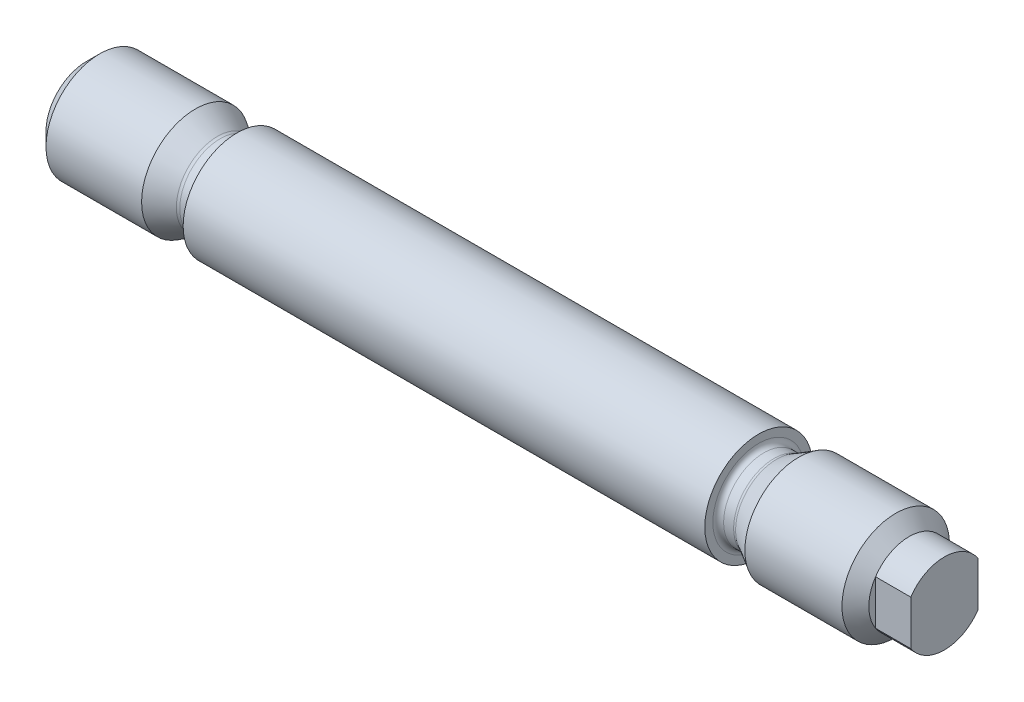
ISO-10303-21;
HEADER;
FILE_DESCRIPTION(('STEP AP214'),'2;1');
FILE_NAME('part.step','',(''),(''),'','','');
FILE_SCHEMA(('AUTOMOTIVE_DESIGN { 1 0 10303 214 1 1 1 1 }'));
ENDSEC;
DATA;
#1=APPLICATION_CONTEXT('core data for automotive mechanical design processes');
#2=APPLICATION_PROTOCOL_DEFINITION('international standard','automotive_design',2000,#1);
#3=PRODUCT_CONTEXT('',#1,'mechanical');
#4=PRODUCT('Part','Part','',(#3));
#5=PRODUCT_RELATED_PRODUCT_CATEGORY('part','',(#4));
#6=PRODUCT_DEFINITION_FORMATION('','',#4);
#7=PRODUCT_DEFINITION_CONTEXT('part definition',#1,'design');
#8=PRODUCT_DEFINITION('design','',#6,#7);
#9=PRODUCT_DEFINITION_SHAPE('','',#8);
#10=(LENGTH_UNIT() NAMED_UNIT(*) SI_UNIT(.MILLI.,.METRE.));
#11=(NAMED_UNIT(*) PLANE_ANGLE_UNIT() SI_UNIT($,.RADIAN.));
#12=(NAMED_UNIT(*) SI_UNIT($,.STERADIAN.) SOLID_ANGLE_UNIT());
#13=UNCERTAINTY_MEASURE_WITH_UNIT(LENGTH_MEASURE(1.E-05),#10,'distance_accuracy_value','');
#14=(GEOMETRIC_REPRESENTATION_CONTEXT(3) GLOBAL_UNCERTAINTY_ASSIGNED_CONTEXT((#13)) GLOBAL_UNIT_ASSIGNED_CONTEXT((#10,
#11,#12)) REPRESENTATION_CONTEXT('',''));
#15=CARTESIAN_POINT('',(0.,0.,0.));
#16=DIRECTION('',(0.,0.,1.));
#17=DIRECTION('',(1.,0.,0.));
#18=AXIS2_PLACEMENT_3D('',#15,#16,#17);
#19=CARTESIAN_POINT('',(122.4,6.,0.));
#20=DIRECTION('',(1.,0.,0.));
#21=DIRECTION('',(0.,0.,-1.));
#22=AXIS2_PLACEMENT_3D('',#19,#20,#21);
#23=PLANE('',#22);
#24=DIRECTION('',(0.,1.,0.));
#25=VECTOR('',#24,1.);
#26=CARTESIAN_POINT('',(122.4,3.3166247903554,-5.));
#27=LINE('',#26,#25);
#28=CARTESIAN_POINT('',(122.4,-3.3166247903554,-5.));
#29=VERTEX_POINT('',#28);
#30=CARTESIAN_POINT('',(122.4,3.3166247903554,-5.));
#31=VERTEX_POINT('',#30);
#32=EDGE_CURVE('E48',#29,#31,#27,.T.);
#33=ORIENTED_EDGE('',*,*,#32,.F.);
#34=CARTESIAN_POINT('',(122.4,0.,0.));
#35=DIRECTION('',(-1.,0.,0.));
#36=DIRECTION('',(0.,0.,1.));
#37=AXIS2_PLACEMENT_3D('',#34,#35,#36);
#38=CIRCLE('',#37,6.);
#39=EDGE_CURVE('E41',#31,#29,#38,.T.);
#40=ORIENTED_EDGE('',*,*,#39,.F.);
#41=EDGE_LOOP('',(#33,#40));
#42=FACE_BOUND('',#41,.T.);
#43=ADVANCED_FACE('F33',(#42),#23,.T.);
#44=CARTESIAN_POINT('',(0.,6.,0.));
#45=DIRECTION('',(1.,0.,0.));
#46=DIRECTION('',(0.,0.,-1.));
#47=AXIS2_PLACEMENT_3D('',#44,#45,#46);
#48=PLANE('',#47);
#49=CARTESIAN_POINT('',(0.,0.,0.));
#50=DIRECTION('',(-1.,0.,0.));
#51=DIRECTION('',(0.,0.,1.));
#52=AXIS2_PLACEMENT_3D('',#49,#50,#51);
#53=CIRCLE('',#52,6.);
#54=CARTESIAN_POINT('',(0.,0.,6.));
#55=VERTEX_POINT('',#54);
#56=EDGE_CURVE('E94',#55,#55,#53,.T.);
#57=ORIENTED_EDGE('',*,*,#56,.T.);
#58=EDGE_LOOP('',(#57));
#59=FACE_BOUND('',#58,.T.);
#60=ADVANCED_FACE('F35',(#59),#48,.F.);
#61=DIRECTION('',(0.,-1.,0.));
#62=VECTOR('',#61,1.);
#63=CARTESIAN_POINT('',(122.4,3.3166247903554,5.));
#64=LINE('',#63,#62);
#65=CARTESIAN_POINT('',(122.4,3.3166247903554,5.));
#66=VERTEX_POINT('',#65);
#67=CARTESIAN_POINT('',(122.4,-3.3166247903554,5.));
#68=VERTEX_POINT('',#67);
#69=EDGE_CURVE('E155',#66,#68,#64,.T.);
#70=ORIENTED_EDGE('',*,*,#69,.F.);
#71=EDGE_CURVE('E42',#68,#66,#38,.T.);
#72=ORIENTED_EDGE('',*,*,#71,.F.);
#73=EDGE_LOOP('',(#70,#72));
#74=FACE_BOUND('',#73,.T.);
#75=ADVANCED_FACE('F166',(#74),#23,.T.);
#76=CARTESIAN_POINT('',(120.4,0.,0.));
#77=DIRECTION('',(-1.,0.,0.));
#78=DIRECTION('',(0.,0.,1.));
#79=AXIS2_PLACEMENT_3D('',#76,#77,#78);
#80=CONICAL_SURFACE('',#79,8.,0.785398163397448);
#81=EDGE_CURVE('E11',#66,#31,#38,.T.);
#82=ORIENTED_EDGE('',*,*,#81,.T.);
#83=ORIENTED_EDGE('',*,*,#39,.T.);
#84=CARTESIAN_POINT('',(122.4,0.,0.));
#85=DIRECTION('',(1.,0.,0.));
#86=DIRECTION('',(0.,0.,-1.));
#87=AXIS2_PLACEMENT_3D('',#84,#85,#86);
#88=CIRCLE('',#87,6.);
#89=EDGE_CURVE('E150',#68,#29,#88,.T.);
#90=ORIENTED_EDGE('',*,*,#89,.F.);
#91=ORIENTED_EDGE('',*,*,#71,.T.);
#92=EDGE_LOOP('',(#82,#83,#90,#91));
#93=FACE_BOUND('',#92,.T.);
#94=CARTESIAN_POINT('',(120.4,0.,0.));
#95=DIRECTION('',(-1.,0.,0.));
#96=DIRECTION('',(0.,0.,1.));
#97=AXIS2_PLACEMENT_3D('',#94,#95,#96);
#98=CIRCLE('',#97,8.);
#99=CARTESIAN_POINT('',(120.4,0.,8.));
#100=VERTEX_POINT('',#99);
#101=EDGE_CURVE('E140',#100,#100,#98,.T.);
#102=ORIENTED_EDGE('',*,*,#101,.F.);
#103=EDGE_LOOP('',(#102));
#104=FACE_BOUND('',#103,.T.);
#105=ADVANCED_FACE('F148',(#93,#104),#80,.T.);
#106=CARTESIAN_POINT('',(-3.175,0.,0.));
#107=DIRECTION('',(-1.,0.,0.));
#108=DIRECTION('',(0.,0.,1.));
#109=AXIS2_PLACEMENT_3D('',#106,#107,#108);
#110=CYLINDRICAL_SURFACE('',#109,8.);
#111=ORIENTED_EDGE('',*,*,#101,.T.);
#112=EDGE_LOOP('',(#111));
#113=FACE_BOUND('',#112,.T.);
#114=CARTESIAN_POINT('',(105.964101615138,0.,0.));
#115=DIRECTION('',(-1.,0.,0.));
#116=DIRECTION('',(0.,0.,1.));
#117=AXIS2_PLACEMENT_3D('',#114,#115,#116);
#118=CIRCLE('',#117,8.);
#119=CARTESIAN_POINT('',(105.964101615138,0.,8.));
#120=VERTEX_POINT('',#119);
#121=EDGE_CURVE('E138',#120,#120,#118,.T.);
#122=ORIENTED_EDGE('',*,*,#121,.F.);
#123=EDGE_LOOP('',(#122));
#124=FACE_BOUND('',#123,.T.);
#125=ADVANCED_FACE('F172',(#113,#124),#110,.T.);
#126=CARTESIAN_POINT('',(102.685640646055,0.,0.));
#127=DIRECTION('',(1.,0.,0.));
#128=DIRECTION('',(0.,0.,-1.));
#129=AXIS2_PLACEMENT_3D('',#126,#127,#128);
#130=CONICAL_SURFACE('',#129,6.10717967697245,0.523598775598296);
#131=ORIENTED_EDGE('',*,*,#121,.T.);
#132=EDGE_LOOP('',(#131));
#133=FACE_BOUND('',#132,.T.);
#134=CARTESIAN_POINT('',(102.685640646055,0.,0.));
#135=DIRECTION('',(-1.,0.,0.));
#136=DIRECTION('',(0.,0.,1.));
#137=AXIS2_PLACEMENT_3D('',#134,#135,#136);
#138=CIRCLE('',#137,6.10717967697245);
#139=CARTESIAN_POINT('',(102.685640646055,0.,6.10717967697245));
#140=VERTEX_POINT('',#139);
#141=EDGE_CURVE('E135',#140,#140,#138,.T.);
#142=ORIENTED_EDGE('',*,*,#141,.F.);
#143=EDGE_LOOP('',(#142));
#144=FACE_BOUND('',#143,.T.);
#145=ADVANCED_FACE('F193',(#133,#144),#130,.T.);
#146=CARTESIAN_POINT('',(102.285640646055,0.,0.));
#147=DIRECTION('',(-1.,0.,0.));
#148=DIRECTION('',(0.,0.,1.));
#149=AXIS2_PLACEMENT_3D('',#146,#147,#148);
#150=TOROIDAL_SURFACE('',#149,6.8,0.8);
#151=ORIENTED_EDGE('',*,*,#141,.T.);
#152=EDGE_LOOP('',(#151));
#153=FACE_BOUND('',#152,.T.);
#154=CARTESIAN_POINT('',(102.285640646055,0.,0.));
#155=DIRECTION('',(-1.,0.,0.));
#156=DIRECTION('',(0.,0.,1.));
#157=AXIS2_PLACEMENT_3D('',#154,#155,#156);
#158=CIRCLE('',#157,6.);
#159=CARTESIAN_POINT('',(102.285640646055,0.,6.));
#160=VERTEX_POINT('',#159);
#161=EDGE_CURVE('E132',#160,#160,#158,.T.);
#162=ORIENTED_EDGE('',*,*,#161,.F.);
#163=EDGE_LOOP('',(#162));
#164=FACE_BOUND('',#163,.T.);
#165=ADVANCED_FACE('F203',(#153,#164),#150,.F.);
#166=CARTESIAN_POINT('',(-3.175,0.,0.));
#167=DIRECTION('',(-1.,0.,0.));
#168=DIRECTION('',(0.,0.,1.));
#169=AXIS2_PLACEMENT_3D('',#166,#167,#168);
#170=CYLINDRICAL_SURFACE('',#169,6.);
#171=ORIENTED_EDGE('',*,*,#161,.T.);
#172=EDGE_LOOP('',(#171));
#173=FACE_BOUND('',#172,.T.);
#174=CARTESIAN_POINT('',(100.8,0.,0.));
#175=DIRECTION('',(-1.,0.,0.));
#176=DIRECTION('',(0.,0.,1.));
#177=AXIS2_PLACEMENT_3D('',#174,#175,#176);
#178=CIRCLE('',#177,6.);
#179=CARTESIAN_POINT('',(100.8,0.,6.));
#180=VERTEX_POINT('',#179);
#181=EDGE_CURVE('E129',#180,#180,#178,.T.);
#182=ORIENTED_EDGE('',*,*,#181,.F.);
#183=EDGE_LOOP('',(#182));
#184=FACE_BOUND('',#183,.T.);
#185=ADVANCED_FACE('F213',(#173,#184),#170,.T.);
#186=CARTESIAN_POINT('',(100.8,0.,0.));
#187=DIRECTION('',(-1.,0.,0.));
#188=DIRECTION('',(0.,0.,1.));
#189=AXIS2_PLACEMENT_3D('',#186,#187,#188);
#190=TOROIDAL_SURFACE('',#189,6.8,0.799999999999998);
#191=ORIENTED_EDGE('',*,*,#181,.T.);
#192=EDGE_LOOP('',(#191));
#193=FACE_BOUND('',#192,.T.);
#194=CARTESIAN_POINT('',(100.,0.,0.));
#195=DIRECTION('',(-1.,0.,0.));
#196=DIRECTION('',(0.,0.,1.));
#197=AXIS2_PLACEMENT_3D('',#194,#195,#196);
#198=CIRCLE('',#197,6.8);
#199=CARTESIAN_POINT('',(100.,0.,6.8));
#200=VERTEX_POINT('',#199);
#201=EDGE_CURVE('E126',#200,#200,#198,.T.);
#202=ORIENTED_EDGE('',*,*,#201,.F.);
#203=EDGE_LOOP('',(#202));
#204=FACE_BOUND('',#203,.T.);
#205=ADVANCED_FACE('F223',(#193,#204),#190,.F.);
#206=CARTESIAN_POINT('',(100.,8.,0.));
#207=DIRECTION('',(1.,0.,0.));
#208=DIRECTION('',(0.,0.,-1.));
#209=AXIS2_PLACEMENT_3D('',#206,#207,#208);
#210=PLANE('',#209);
#211=ORIENTED_EDGE('',*,*,#201,.T.);
#212=EDGE_LOOP('',(#211));
#213=FACE_BOUND('',#212,.T.);
#214=CARTESIAN_POINT('',(100.,0.,0.));
#215=DIRECTION('',(-1.,0.,0.));
#216=DIRECTION('',(0.,0.,1.));
#217=AXIS2_PLACEMENT_3D('',#214,#215,#216);
#218=CIRCLE('',#217,8.);
#219=CARTESIAN_POINT('',(100.,0.,8.));
#220=VERTEX_POINT('',#219);
#221=EDGE_CURVE('E123',#220,#220,#218,.T.);
#222=ORIENTED_EDGE('',*,*,#221,.F.);
#223=EDGE_LOOP('',(#222));
#224=FACE_BOUND('',#223,.T.);
#225=ADVANCED_FACE('F233',(#213,#224),#210,.T.);
#226=CARTESIAN_POINT('',(-3.175,0.,0.));
#227=DIRECTION('',(-1.,0.,0.));
#228=DIRECTION('',(0.,0.,1.));
#229=AXIS2_PLACEMENT_3D('',#226,#227,#228);
#230=CYLINDRICAL_SURFACE('',#229,8.);
#231=ORIENTED_EDGE('',*,*,#221,.T.);
#232=EDGE_LOOP('',(#231));
#233=FACE_BOUND('',#232,.T.);
#234=CARTESIAN_POINT('',(22.4,0.,0.));
#235=DIRECTION('',(-1.,0.,0.));
#236=DIRECTION('',(0.,0.,1.));
#237=AXIS2_PLACEMENT_3D('',#234,#235,#236);
#238=CIRCLE('',#237,8.);
#239=CARTESIAN_POINT('',(22.4,0.,8.));
#240=VERTEX_POINT('',#239);
#241=EDGE_CURVE('E120',#240,#240,#238,.T.);
#242=ORIENTED_EDGE('',*,*,#241,.F.);
#243=EDGE_LOOP('',(#242));
#244=FACE_BOUND('',#243,.T.);
#245=ADVANCED_FACE('F243',(#233,#244),#230,.T.);
#246=CARTESIAN_POINT('',(22.4,8.,0.));
#247=DIRECTION('',(1.,0.,0.));
#248=DIRECTION('',(0.,0.,-1.));
#249=AXIS2_PLACEMENT_3D('',#246,#247,#248);
#250=PLANE('',#249);
#251=CARTESIAN_POINT('',(22.4,0.,0.));
#252=DIRECTION('',(-1.,0.,0.));
#253=DIRECTION('',(0.,0.,1.));
#254=AXIS2_PLACEMENT_3D('',#251,#252,#253);
#255=CIRCLE('',#254,6.8);
#256=CARTESIAN_POINT('',(22.4,0.,6.8));
#257=VERTEX_POINT('',#256);
#258=EDGE_CURVE('E117',#257,#257,#255,.T.);
#259=ORIENTED_EDGE('',*,*,#258,.F.);
#260=EDGE_LOOP('',(#259));
#261=FACE_BOUND('',#260,.T.);
#262=ORIENTED_EDGE('',*,*,#241,.T.);
#263=EDGE_LOOP('',(#262));
#264=FACE_BOUND('',#263,.T.);
#265=ADVANCED_FACE('F253',(#261,#264),#250,.F.);
#266=CARTESIAN_POINT('',(21.6,0.,0.));
#267=DIRECTION('',(-1.,0.,0.));
#268=DIRECTION('',(0.,0.,1.));
#269=AXIS2_PLACEMENT_3D('',#266,#267,#268);
#270=TOROIDAL_SURFACE('',#269,6.8,0.799999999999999);
#271=CARTESIAN_POINT('',(21.6,0.,0.));
#272=DIRECTION('',(-1.,0.,0.));
#273=DIRECTION('',(0.,0.,1.));
#274=AXIS2_PLACEMENT_3D('',#271,#272,#273);
#275=CIRCLE('',#274,6.);
#276=CARTESIAN_POINT('',(21.6,0.,6.));
#277=VERTEX_POINT('',#276);
#278=EDGE_CURVE('E114',#277,#277,#275,.T.);
#279=ORIENTED_EDGE('',*,*,#278,.F.);
#280=EDGE_LOOP('',(#279));
#281=FACE_BOUND('',#280,.T.);
#282=ORIENTED_EDGE('',*,*,#258,.T.);
#283=EDGE_LOOP('',(#282));
#284=FACE_BOUND('',#283,.T.);
#285=ADVANCED_FACE('F263',(#281,#284),#270,.F.);
#286=CARTESIAN_POINT('',(-3.175,0.,0.));
#287=DIRECTION('',(-1.,0.,0.));
#288=DIRECTION('',(0.,0.,1.));
#289=AXIS2_PLACEMENT_3D('',#286,#287,#288);
#290=CYLINDRICAL_SURFACE('',#289,6.);
#291=CARTESIAN_POINT('',(19.9,0.,0.));
#292=DIRECTION('',(-1.,0.,0.));
#293=DIRECTION('',(0.,0.,1.));
#294=AXIS2_PLACEMENT_3D('',#291,#292,#293);
#295=CIRCLE('',#294,6.);
#296=CARTESIAN_POINT('',(19.9,0.,6.));
#297=VERTEX_POINT('',#296);
#298=EDGE_CURVE('E111',#297,#297,#295,.T.);
#299=ORIENTED_EDGE('',*,*,#298,.F.);
#300=EDGE_LOOP('',(#299));
#301=FACE_BOUND('',#300,.T.);
#302=ORIENTED_EDGE('',*,*,#278,.T.);
#303=EDGE_LOOP('',(#302));
#304=FACE_BOUND('',#303,.T.);
#305=ADVANCED_FACE('F273',(#301,#304),#290,.T.);
#306=CARTESIAN_POINT('',(19.9,0.,0.));
#307=DIRECTION('',(-1.,0.,0.));
#308=DIRECTION('',(0.,0.,1.));
#309=AXIS2_PLACEMENT_3D('',#306,#307,#308);
#310=TOROIDAL_SURFACE('',#309,6.8,0.8);
#311=CARTESIAN_POINT('',(19.5,0.,0.));
#312=DIRECTION('',(-1.,0.,0.));
#313=DIRECTION('',(0.,0.,1.));
#314=AXIS2_PLACEMENT_3D('',#311,#312,#313);
#315=CIRCLE('',#314,6.10717967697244);
#316=CARTESIAN_POINT('',(19.5,0.,6.10717967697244));
#317=VERTEX_POINT('',#316);
#318=EDGE_CURVE('E108',#317,#317,#315,.T.);
#319=ORIENTED_EDGE('',*,*,#318,.F.);
#320=EDGE_LOOP('',(#319));
#321=FACE_BOUND('',#320,.T.);
#322=ORIENTED_EDGE('',*,*,#298,.T.);
#323=EDGE_LOOP('',(#322));
#324=FACE_BOUND('',#323,.T.);
#325=ADVANCED_FACE('F283',(#321,#324),#310,.F.);
#326=CARTESIAN_POINT('',(19.5,0.,0.));
#327=DIRECTION('',(-1.,0.,0.));
#328=DIRECTION('',(0.,0.,1.));
#329=AXIS2_PLACEMENT_3D('',#326,#327,#328);
#330=CONICAL_SURFACE('',#329,6.10717967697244,0.523598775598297);
#331=CARTESIAN_POINT('',(16.2215390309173,0.,0.));
#332=DIRECTION('',(-1.,0.,0.));
#333=DIRECTION('',(0.,0.,1.));
#334=AXIS2_PLACEMENT_3D('',#331,#332,#333);
#335=CIRCLE('',#334,8.);
#336=CARTESIAN_POINT('',(16.2215390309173,0.,8.));
#337=VERTEX_POINT('',#336);
#338=EDGE_CURVE('E105',#337,#337,#335,.T.);
#339=ORIENTED_EDGE('',*,*,#338,.F.);
#340=EDGE_LOOP('',(#339));
#341=FACE_BOUND('',#340,.T.);
#342=ORIENTED_EDGE('',*,*,#318,.T.);
#343=EDGE_LOOP('',(#342));
#344=FACE_BOUND('',#343,.T.);
#345=ADVANCED_FACE('F293',(#341,#344),#330,.T.);
#346=CARTESIAN_POINT('',(-3.175,0.,0.));
#347=DIRECTION('',(-1.,0.,0.));
#348=DIRECTION('',(0.,0.,1.));
#349=AXIS2_PLACEMENT_3D('',#346,#347,#348);
#350=CYLINDRICAL_SURFACE('',#349,8.);
#351=CARTESIAN_POINT('',(1.99999999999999,0.,0.));
#352=DIRECTION('',(-1.,0.,0.));
#353=DIRECTION('',(0.,0.,1.));
#354=AXIS2_PLACEMENT_3D('',#351,#352,#353);
#355=CIRCLE('',#354,8.);
#356=CARTESIAN_POINT('',(1.99999999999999,0.,8.));
#357=VERTEX_POINT('',#356);
#358=EDGE_CURVE('E97',#357,#357,#355,.T.);
#359=ORIENTED_EDGE('',*,*,#358,.F.);
#360=EDGE_LOOP('',(#359));
#361=FACE_BOUND('',#360,.T.);
#362=ORIENTED_EDGE('',*,*,#338,.T.);
#363=EDGE_LOOP('',(#362));
#364=FACE_BOUND('',#363,.T.);
#365=ADVANCED_FACE('F303',(#361,#364),#350,.T.);
#366=CARTESIAN_POINT('',(1.99999999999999,0.,0.));
#367=DIRECTION('',(1.,0.,0.));
#368=DIRECTION('',(0.,0.,-1.));
#369=AXIS2_PLACEMENT_3D('',#366,#367,#368);
#370=CONICAL_SURFACE('',#369,8.,0.78539816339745);
#371=ORIENTED_EDGE('',*,*,#56,.F.);
#372=EDGE_LOOP('',(#371));
#373=FACE_BOUND('',#372,.T.);
#374=ORIENTED_EDGE('',*,*,#358,.T.);
#375=EDGE_LOOP('',(#374));
#376=FACE_BOUND('',#375,.T.);
#377=ADVANCED_FACE('F312',(#373,#376),#370,.T.);
#378=CARTESIAN_POINT('',(127.64,0.,0.));
#379=DIRECTION('',(-1.,0.,0.));
#380=DIRECTION('',(0.,0.,1.));
#381=AXIS2_PLACEMENT_3D('',#378,#379,#380);
#382=CYLINDRICAL_SURFACE('',#381,6.);
#383=ORIENTED_EDGE('',*,*,#81,.F.);
#384=DIRECTION('',(-1.,0.,0.));
#385=VECTOR('',#384,1.);
#386=CARTESIAN_POINT('',(127.64,3.3166247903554,5.));
#387=LINE('',#386,#385);
#388=CARTESIAN_POINT('',(127.64,3.3166247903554,5.));
#389=VERTEX_POINT('',#388);
#390=EDGE_CURVE('E76',#389,#66,#387,.T.);
#391=ORIENTED_EDGE('',*,*,#390,.F.);
#392=CARTESIAN_POINT('',(127.64,0.,0.));
#393=DIRECTION('',(1.,0.,0.));
#394=DIRECTION('',(0.,0.,-1.));
#395=AXIS2_PLACEMENT_3D('',#392,#393,#394);
#396=CIRCLE('',#395,6.);
#397=CARTESIAN_POINT('',(127.64,3.3166247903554,-5.));
#398=VERTEX_POINT('',#397);
#399=EDGE_CURVE('E83',#398,#389,#396,.T.);
#400=ORIENTED_EDGE('',*,*,#399,.F.);
#401=DIRECTION('',(-1.,0.,0.));
#402=VECTOR('',#401,1.);
#403=CARTESIAN_POINT('',(127.64,3.3166247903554,-5.));
#404=LINE('',#403,#402);
#405=EDGE_CURVE('E159',#398,#31,#404,.T.);
#406=ORIENTED_EDGE('',*,*,#405,.T.);
#407=EDGE_LOOP('',(#383,#391,#400,#406));
#408=FACE_BOUND('',#407,.T.);
#409=ADVANCED_FACE('F93',(#408),#382,.T.);
#410=CARTESIAN_POINT('',(127.64,3.3166247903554,5.));
#411=DIRECTION('',(0.,0.,-1.));
#412=DIRECTION('',(-1.,0.,0.));
#413=AXIS2_PLACEMENT_3D('',#410,#411,#412);
#414=PLANE('',#413);
#415=ORIENTED_EDGE('',*,*,#69,.T.);
#416=DIRECTION('',(-1.,0.,0.));
#417=VECTOR('',#416,1.);
#418=CARTESIAN_POINT('',(127.64,-3.3166247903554,5.));
#419=LINE('',#418,#417);
#420=CARTESIAN_POINT('',(127.64,-3.3166247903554,5.));
#421=VERTEX_POINT('',#420);
#422=EDGE_CURVE('E79',#421,#68,#419,.T.);
#423=ORIENTED_EDGE('',*,*,#422,.F.);
#424=DIRECTION('',(0.,-1.,0.));
#425=VECTOR('',#424,1.);
#426=CARTESIAN_POINT('',(127.64,3.3166247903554,5.));
#427=LINE('',#426,#425);
#428=EDGE_CURVE('E71',#389,#421,#427,.T.);
#429=ORIENTED_EDGE('',*,*,#428,.F.);
#430=ORIENTED_EDGE('',*,*,#390,.T.);
#431=EDGE_LOOP('',(#415,#423,#429,#430));
#432=FACE_BOUND('',#431,.T.);
#433=ADVANCED_FACE('F74',(#432),#414,.F.);
#434=CARTESIAN_POINT('',(127.64,0.,0.));
#435=DIRECTION('',(-1.,0.,0.));
#436=DIRECTION('',(0.,0.,1.));
#437=AXIS2_PLACEMENT_3D('',#434,#435,#436);
#438=CYLINDRICAL_SURFACE('',#437,6.);
#439=ORIENTED_EDGE('',*,*,#89,.T.);
#440=DIRECTION('',(-1.,0.,0.));
#441=VECTOR('',#440,1.);
#442=CARTESIAN_POINT('',(127.64,-3.3166247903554,-5.));
#443=LINE('',#442,#441);
#444=CARTESIAN_POINT('',(127.64,-3.3166247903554,-5.));
#445=VERTEX_POINT('',#444);
#446=EDGE_CURVE('E99',#445,#29,#443,.T.);
#447=ORIENTED_EDGE('',*,*,#446,.F.);
#448=CARTESIAN_POINT('',(127.64,0.,0.));
#449=DIRECTION('',(1.,0.,0.));
#450=DIRECTION('',(0.,0.,-1.));
#451=AXIS2_PLACEMENT_3D('',#448,#449,#450);
#452=CIRCLE('',#451,6.);
#453=EDGE_CURVE('E82',#421,#445,#452,.T.);
#454=ORIENTED_EDGE('',*,*,#453,.F.);
#455=ORIENTED_EDGE('',*,*,#422,.T.);
#456=EDGE_LOOP('',(#439,#447,#454,#455));
#457=FACE_BOUND('',#456,.T.);
#458=ADVANCED_FACE('F154',(#457),#438,.T.);
#459=CARTESIAN_POINT('',(127.64,3.3166247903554,-5.));
#460=DIRECTION('',(0.,0.,1.));
#461=DIRECTION('',(0.,-1.,0.));
#462=AXIS2_PLACEMENT_3D('',#459,#460,#461);
#463=PLANE('',#462);
#464=ORIENTED_EDGE('',*,*,#32,.T.);
#465=ORIENTED_EDGE('',*,*,#405,.F.);
#466=DIRECTION('',(0.,1.,0.));
#467=VECTOR('',#466,1.);
#468=CARTESIAN_POINT('',(127.64,3.3166247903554,-5.));
#469=LINE('',#468,#467);
#470=EDGE_CURVE('E88',#445,#398,#469,.T.);
#471=ORIENTED_EDGE('',*,*,#470,.F.);
#472=ORIENTED_EDGE('',*,*,#446,.T.);
#473=EDGE_LOOP('',(#464,#465,#471,#472));
#474=FACE_BOUND('',#473,.T.);
#475=ADVANCED_FACE('F158',(#474),#463,.F.);
#476=CARTESIAN_POINT('',(127.64,0.,0.));
#477=DIRECTION('',(1.,0.,0.));
#478=DIRECTION('',(0.,0.,-1.));
#479=AXIS2_PLACEMENT_3D('',#476,#477,#478);
#480=PLANE('',#479);
#481=ORIENTED_EDGE('',*,*,#399,.T.);
#482=ORIENTED_EDGE('',*,*,#428,.T.);
#483=ORIENTED_EDGE('',*,*,#453,.T.);
#484=ORIENTED_EDGE('',*,*,#470,.T.);
#485=EDGE_LOOP('',(#481,#482,#483,#484));
#486=FACE_BOUND('',#485,.T.);
#487=ADVANCED_FACE('F86',(#486),#480,.T.);
#488=CLOSED_SHELL('',(#43,#60,#75,#105,#125,#145,#165,#185,#205,#225,#245,#265,#285,#305,#325,
#345,#365,#377,#409,#433,#458,#475,#487));
#489=MANIFOLD_SOLID_BREP('B2',#488);
#490=ADVANCED_BREP_SHAPE_REPRESENTATION('',(#18,#489),#14);
#491=SHAPE_DEFINITION_REPRESENTATION(#9,#490);
ENDSEC;
END-ISO-10303-21;
